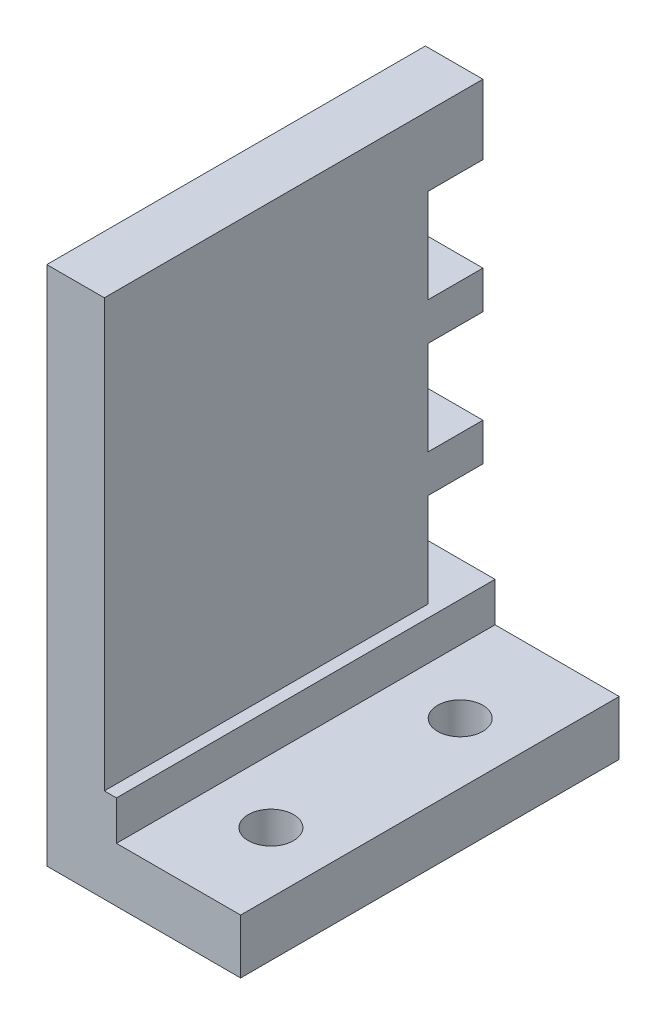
from build123d import *

# Parameters (mm, degrees)
BOSS_EXTRUDE1_DEPTH   = 31.75
F_6_CLEARANCE_HOLE1_D = 3.7973
CUT_EXTRUDE1_REACH    = 57.203
SKETCH5_W             = 4.6228
SKETCH5_H             = 7.874


with BuildPart() as part:
    # Sketch1 → Boss-Extrude1 (new body)
    with BuildSketch(Plane.XY):
        Polygon((0, 43.688), (0, 0), (16.256, 0), (16.256, 4.572), (5.842, 4.572), (5.842, 7.874), (4.826, 7.874), (4.826, 43.688), align=None)
    extrude(amount=BOSS_EXTRUDE1_DEPTH)

    # 6 Clearance Hole1 (through all)
    with Locations(Plane(origin=(0, 0, 0), x_dir=(-1, 0, 0), z_dir=(0, -1, 0))):
        with Locations((-11.176, -24.13), (-11.176, -8.255)):
            Hole(F_6_CLEARANCE_HOLE1_D / 2)

    # Sketch5 → Cut-Extrude1 (cut, up to next)
    with BuildSketch(Plane(origin=(4.826, 0, 0), x_dir=(0, 0, -1), z_dir=(1, 0, 0)), mode=Mode.PRIVATE) as cut_extrude1_sk1:
        with Locations((-2.3114, 33.909)):
            Rectangle(SKETCH5_W, SKETCH5_H)
    cut_extrude1_tool1 = extrude(cut_extrude1_sk1.sketch, amount=-CUT_EXTRUDE1_REACH, mode=Mode.PRIVATE) & part.part
    # Sketch5 → Cut-Extrude1 (cut, up to next)
    with BuildSketch(Plane(origin=(4.826, 0, 0), x_dir=(0, 0, -1), z_dir=(1, 0, 0)), mode=Mode.PRIVATE) as cut_extrude1_sk2:
        with Locations((-2.3114, 22.86)):
            Rectangle(SKETCH5_W, SKETCH5_H)
    cut_extrude1_tool2 = extrude(cut_extrude1_sk2.sketch, amount=-CUT_EXTRUDE1_REACH, mode=Mode.PRIVATE) & part.part
    # Sketch5 → Cut-Extrude1 (cut, up to next)
    with BuildSketch(Plane(origin=(4.826, 0, 0), x_dir=(0, 0, -1), z_dir=(1, 0, 0)), mode=Mode.PRIVATE) as cut_extrude1_sk3:
        with Locations((-2.3114, 11.811)):
            Rectangle(SKETCH5_W, SKETCH5_H)
    cut_extrude1_tool3 = extrude(cut_extrude1_sk3.sketch, amount=-CUT_EXTRUDE1_REACH, mode=Mode.PRIVATE) & part.part
    add(cut_extrude1_tool1.solids().sort_by_distance((4.826, 33.909, 2.3114))[0], mode=Mode.SUBTRACT)
    add(cut_extrude1_tool2.solids().sort_by_distance((4.826, 22.86, 2.3114))[0], mode=Mode.SUBTRACT)
    add(cut_extrude1_tool3.solids().sort_by_distance((4.826, 11.811, 2.3114))[0], mode=Mode.SUBTRACT)


solid = part.part
